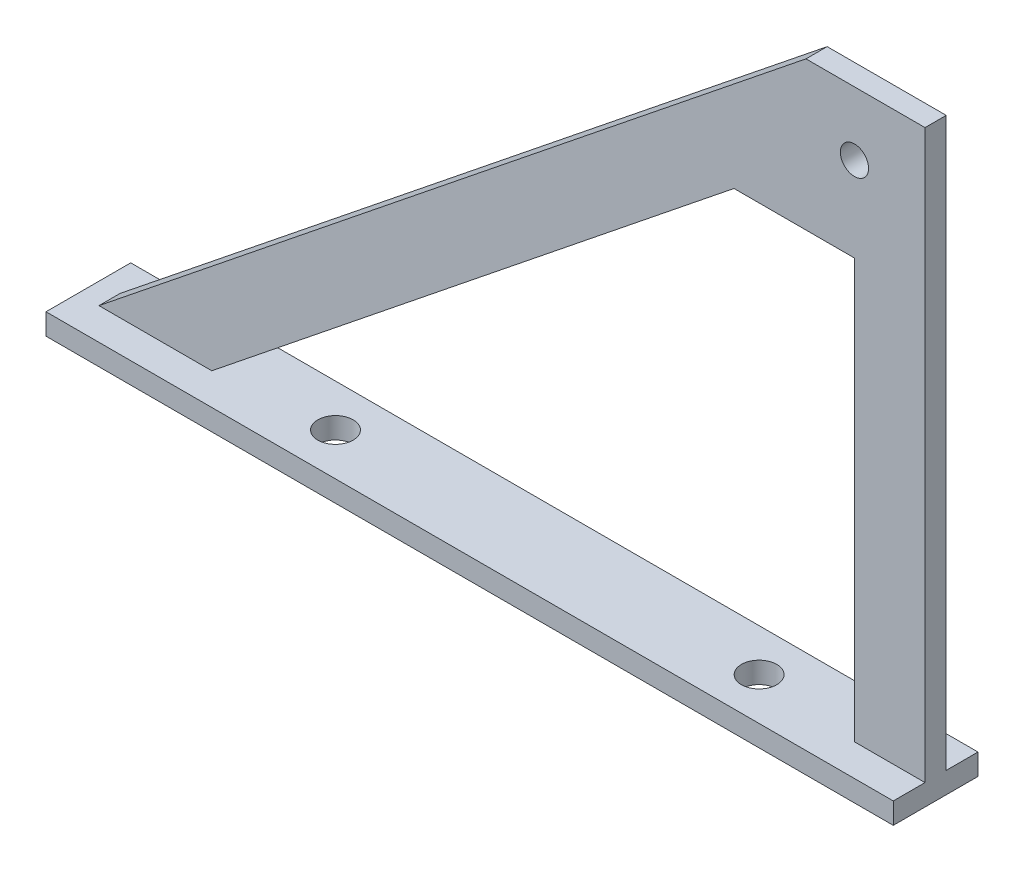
from build123d import *

# Parameters (mm, degrees)
SKETCH1_W             = 120
SKETCH1_H             = 12
BOSS_EXTRUDE1_DEPTH   = 3
BOSS_EXTRUDE1_2_DEPTH = 3
BOSS_EXTRUDE2_START   = -7.5
BOSS_EXTRUDE2_DEPTH   = 3
BOSS_EXTRUDE3_START   = -7.5
BOSS_EXTRUDE3_DEPTH   = 3
SKETCH4_R             = 2.5
CUT_EXTRUDE1_DEPTH    = 7
BOSS_EXTRUDE4_DEPTH   = 3
BOSS_EXTRUDE5_DEPTH   = 3
SKETCH7_R             = 2
CUT_EXTRUDE2_DEPTH    = 120
CUT_EXTRUDE3_DEPTH    = 120
SKETCH9_W             = 171.04034978
SKETCH9_H             = 112.847032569
CUT_EXTRUDE4_DEPTH    = 20


with BuildPart() as part:
    # Sketch1 → Boss-Extrude1 (new body)
    with BuildSketch(Plane(origin=(0, 0, 0), x_dir=(1, 0, 0), z_dir=(0, 1, 0))):
        with Locations((0, -56)):
            Rectangle(SKETCH1_W, SKETCH1_H)
    extrude(amount=BOSS_EXTRUDE1_DEPTH)

    # Sketch2 → Boss-Extrude2 (add)
    with BuildSketch(Plane.XY.offset(62).offset(BOSS_EXTRUDE2_START)):
        Polygon((-57, 3), (60, 96.866927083), (60, 3), (50, 3), (50, 76.023599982), (-41.019930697, 3), align=None)
    extrude(amount=BOSS_EXTRUDE2_DEPTH)


with BuildPart() as body_2:
    # Sketch1 → Boss-Extrude1 2 (new body)
    with BuildSketch(Plane(origin=(0, 0, 0), x_dir=(1, 0, 0), z_dir=(0, 1, 0))):
        with Locations((0, 56)):
            Rectangle(SKETCH1_W, SKETCH1_H)
    extrude(amount=BOSS_EXTRUDE1_2_DEPTH)

    # Sketch3 → Boss-Extrude3 (add)
    with BuildSketch(Plane.XY.offset(-50).offset(BOSS_EXTRUDE3_START)):
        Polygon((60, 96.866927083), (-57, 3), (-41.019930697, 3), (50, 76.023599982), (50, 3), (60, 3), align=None)
    extrude(amount=BOSS_EXTRUDE3_DEPTH)


with BuildPart() as cut_extrude1_tool:
    # Sketch4 → Cut-Extrude1 (new body)
    with BuildSketch(Plane(origin=(0, 3, 0), x_dir=(1, 0, 0), z_dir=(0, 1, 0))):
        with Locations(Location((-25, 56, 0), (0, 0, 270))):
            Circle(SKETCH4_R)
        with Locations(Location((35, 56, 0), (0, 0, 270))):
            Circle(SKETCH4_R)
        with Locations(Location((-25, -56, 0), (0, 0, 270))):
            Circle(SKETCH4_R)
        with Locations(Location((35, -56, 0), (0, 0, 270))):
            Circle(SKETCH4_R)
    extrude(amount=-CUT_EXTRUDE1_DEPTH)


with BuildPart() as part_1:
    add(part.part)

    # Cut-Extrude1: cut by cut_extrude1_tool
    add(cut_extrude1_tool.part, mode=Mode.SUBTRACT)

    # Sketch5 → Boss-Extrude4 (add)
    with BuildSketch(Plane.XY.offset(57.5)):
        Polygon((32.94293004, 62.339029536), (50, 62.339029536), (55.48943836, 62.339029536), (55.48943836, 76.828036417), (50, 83.67032164), (32.94293004, 69.985751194), align=None)
    extrude(amount=-BOSS_EXTRUDE4_DEPTH)


with BuildPart() as body_2_1:
    add(body_2.part)

    # Cut-Extrude1: cut by cut_extrude1_tool
    add(cut_extrude1_tool.part, mode=Mode.SUBTRACT)

    # Sketch6 → Boss-Extrude5 (add)
    with BuildSketch(Plane.XY.offset(-54.5)):
        Polygon((32.94293004, 62.339029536), (50, 62.339029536), (55.48943836, 62.339029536), (55.48943836, 76.828036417), (50, 83.67032164), (32.94293004, 69.985751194), align=None)
    extrude(amount=-BOSS_EXTRUDE5_DEPTH)


with BuildPart() as cut_extrude2_tool:
    # Sketch7 → Cut-Extrude2 (new body)
    with BuildSketch(Plane.XY.offset(57.5)):
        with Locations((50, 74.339029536)):
            Circle(SKETCH7_R)
    extrude(amount=-CUT_EXTRUDE2_DEPTH)


with BuildPart() as part_2:
    add(part_1.part)

    # Cut-Extrude2: cut by cut_extrude2_tool
    add(cut_extrude2_tool.part, mode=Mode.SUBTRACT)


with BuildPart() as body_2_2:
    add(body_2_1.part)

    # Cut-Extrude2: cut by cut_extrude2_tool
    add(cut_extrude2_tool.part, mode=Mode.SUBTRACT)


with BuildPart() as cut_extrude3_tool:
    # Sketch8 → Cut-Extrude3 (new body)
    with BuildSketch(Plane.XY.offset(57.5)):
        Polygon((60, 83.339029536), (43.138214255, 83.339029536), (60, 96.866927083), align=None)
    extrude(amount=-CUT_EXTRUDE3_DEPTH)


with BuildPart() as part_3:
    add(part_2.part)

    # Cut-Extrude3: cut by cut_extrude3_tool
    add(cut_extrude3_tool.part, mode=Mode.SUBTRACT)


with BuildPart() as body_2_3:
    add(body_2_2.part)

    # Cut-Extrude3: cut by cut_extrude3_tool
    add(cut_extrude3_tool.part, mode=Mode.SUBTRACT)

    # Sketch9 → Cut-Extrude4 (cut)
    with BuildSketch(Plane.XY.offset(-50)):
        with Locations((18.485934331, 31.433371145)):
            Rectangle(SKETCH9_W, SKETCH9_H)
    extrude(amount=-CUT_EXTRUDE4_DEPTH, mode=Mode.SUBTRACT)


solid = part_3.part
